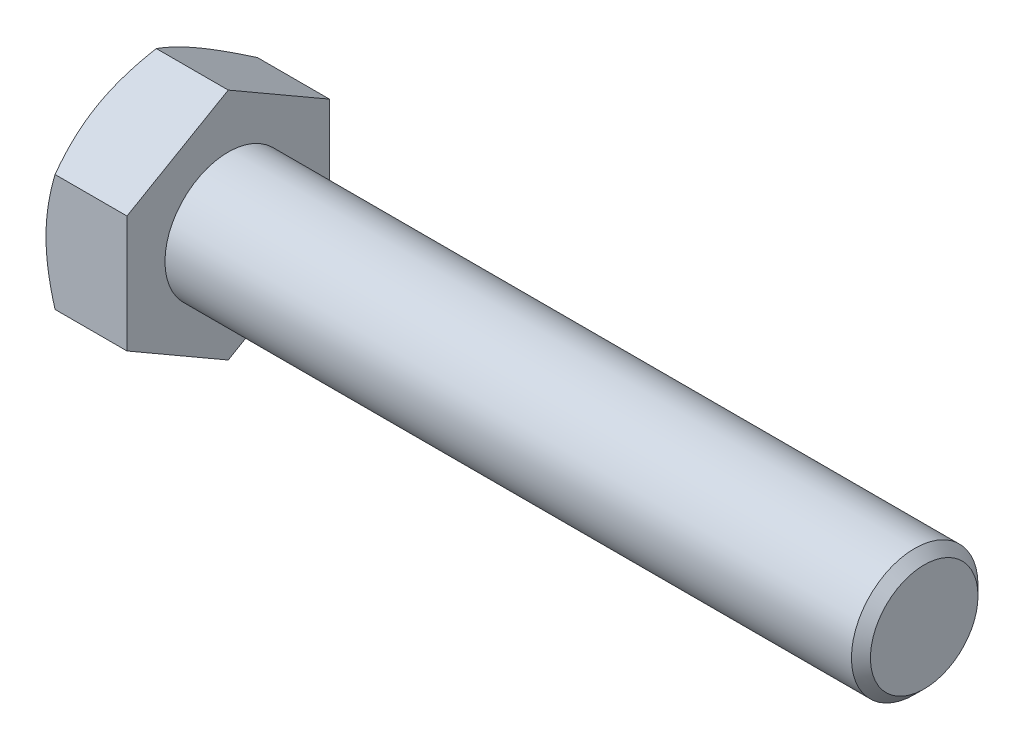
ISO-10303-21;
HEADER;
FILE_DESCRIPTION(('STEP AP214'),'2;1');
FILE_NAME('part.step','',(''),(''),'','','');
FILE_SCHEMA(('AUTOMOTIVE_DESIGN { 1 0 10303 214 1 1 1 1 }'));
ENDSEC;
DATA;
#1=APPLICATION_CONTEXT('core data for automotive mechanical design processes');
#2=APPLICATION_PROTOCOL_DEFINITION('international standard','automotive_design',2000,#1);
#3=PRODUCT_CONTEXT('',#1,'mechanical');
#4=PRODUCT('Part','Part','',(#3));
#5=PRODUCT_RELATED_PRODUCT_CATEGORY('part','',(#4));
#6=PRODUCT_DEFINITION_FORMATION('','',#4);
#7=PRODUCT_DEFINITION_CONTEXT('part definition',#1,'design');
#8=PRODUCT_DEFINITION('design','',#6,#7);
#9=PRODUCT_DEFINITION_SHAPE('','',#8);
#10=(LENGTH_UNIT() NAMED_UNIT(*) SI_UNIT(.MILLI.,.METRE.));
#11=(NAMED_UNIT(*) PLANE_ANGLE_UNIT() SI_UNIT($,.RADIAN.));
#12=(NAMED_UNIT(*) SI_UNIT($,.STERADIAN.) SOLID_ANGLE_UNIT());
#13=UNCERTAINTY_MEASURE_WITH_UNIT(LENGTH_MEASURE(1.E-05),#10,'distance_accuracy_value','');
#14=(GEOMETRIC_REPRESENTATION_CONTEXT(3) GLOBAL_UNCERTAINTY_ASSIGNED_CONTEXT((#13)) GLOBAL_UNIT_ASSIGNED_CONTEXT((#10,
#11,#12)) REPRESENTATION_CONTEXT('',''));
#15=CARTESIAN_POINT('',(0.,0.,0.));
#16=DIRECTION('',(0.,0.,1.));
#17=DIRECTION('',(1.,0.,0.));
#18=AXIS2_PLACEMENT_3D('',#15,#16,#17);
#19=CARTESIAN_POINT('',(55.,0.,0.));
#20=DIRECTION('',(-1.,0.,0.));
#21=DIRECTION('',(0.,0.,1.));
#22=AXIS2_PLACEMENT_3D('',#19,#20,#21);
#23=CYLINDRICAL_SURFACE('',#22,5.);
#24=CARTESIAN_POINT('',(54.25,0.,0.));
#25=DIRECTION('',(1.,0.,0.));
#26=DIRECTION('',(0.,0.,-1.));
#27=AXIS2_PLACEMENT_3D('',#24,#25,#26);
#28=CIRCLE('',#27,5.);
#29=CARTESIAN_POINT('',(54.25,0.,-5.));
#30=VERTEX_POINT('',#29);
#31=EDGE_CURVE('E11',#30,#30,#28,.F.);
#32=ORIENTED_EDGE('',*,*,#31,.T.);
#33=EDGE_LOOP('',(#32));
#34=FACE_BOUND('',#33,.T.);
#35=CARTESIAN_POINT('',(0.,0.,0.));
#36=DIRECTION('',(-1.,0.,0.));
#37=DIRECTION('',(0.,0.,1.));
#38=AXIS2_PLACEMENT_3D('',#35,#36,#37);
#39=CIRCLE('',#38,5.);
#40=CARTESIAN_POINT('',(0.,0.,5.));
#41=VERTEX_POINT('',#40);
#42=EDGE_CURVE('E202',#41,#41,#39,.T.);
#43=ORIENTED_EDGE('',*,*,#42,.F.);
#44=EDGE_LOOP('',(#43));
#45=FACE_BOUND('',#44,.T.);
#46=ADVANCED_FACE('F28',(#34,#45),#23,.T.);
#47=CARTESIAN_POINT('',(55.,0.,0.));
#48=DIRECTION('',(1.,0.,0.));
#49=DIRECTION('',(0.,0.,-1.));
#50=AXIS2_PLACEMENT_3D('',#47,#48,#49);
#51=PLANE('',#50);
#52=CARTESIAN_POINT('',(55.,0.,0.));
#53=DIRECTION('',(1.,0.,0.));
#54=DIRECTION('',(0.,0.,-1.));
#55=AXIS2_PLACEMENT_3D('',#52,#53,#54);
#56=CIRCLE('',#55,4.24999999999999);
#57=CARTESIAN_POINT('',(55.,0.,-4.24999999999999));
#58=VERTEX_POINT('',#57);
#59=EDGE_CURVE('E35',#58,#58,#56,.T.);
#60=ORIENTED_EDGE('',*,*,#59,.T.);
#61=EDGE_LOOP('',(#60));
#62=FACE_BOUND('',#61,.T.);
#63=ADVANCED_FACE('F188',(#62),#51,.T.);
#64=CARTESIAN_POINT('',(0.,-9.23760430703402,0.));
#65=DIRECTION('',(-1.,0.,0.));
#66=DIRECTION('',(0.,0.,1.));
#67=AXIS2_PLACEMENT_3D('',#64,#65,#66);
#68=PLANE('',#67);
#69=DIRECTION('',(0.,0.5,0.866025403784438));
#70=VECTOR('',#69,1.);
#71=CARTESIAN_POINT('',(0.,-9.23760430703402,0.));
#72=LINE('',#71,#70);
#73=CARTESIAN_POINT('',(0.,-9.23760430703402,0.));
#74=VERTEX_POINT('',#73);
#75=CARTESIAN_POINT('',(0.,-4.618802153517,8.));
#76=VERTEX_POINT('',#75);
#77=EDGE_CURVE('E229',#74,#76,#72,.T.);
#78=ORIENTED_EDGE('',*,*,#77,.F.);
#79=DIRECTION('',(0.,0.5,-0.866025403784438));
#80=VECTOR('',#79,1.);
#81=CARTESIAN_POINT('',(0.,-9.23760430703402,0.));
#82=LINE('',#81,#80);
#83=CARTESIAN_POINT('',(0.,-4.618802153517,-8.));
#84=VERTEX_POINT('',#83);
#85=EDGE_CURVE('E216',#74,#84,#82,.T.);
#86=ORIENTED_EDGE('',*,*,#85,.T.);
#87=DIRECTION('',(0.,1.,0.));
#88=VECTOR('',#87,1.);
#89=CARTESIAN_POINT('',(0.,-4.618802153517,-8.));
#90=LINE('',#89,#88);
#91=CARTESIAN_POINT('',(0.,4.61880215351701,-8.));
#92=VERTEX_POINT('',#91);
#93=EDGE_CURVE('E219',#84,#92,#90,.T.);
#94=ORIENTED_EDGE('',*,*,#93,.T.);
#95=DIRECTION('',(0.,0.5,0.866025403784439));
#96=VECTOR('',#95,1.);
#97=CARTESIAN_POINT('',(0.,4.61880215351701,-8.));
#98=LINE('',#97,#96);
#99=CARTESIAN_POINT('',(0.,9.23760430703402,0.));
#100=VERTEX_POINT('',#99);
#101=EDGE_CURVE('E222',#92,#100,#98,.T.);
#102=ORIENTED_EDGE('',*,*,#101,.T.);
#103=DIRECTION('',(0.,0.5,-0.866025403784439));
#104=VECTOR('',#103,1.);
#105=CARTESIAN_POINT('',(0.,4.61880215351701,8.));
#106=LINE('',#105,#104);
#107=CARTESIAN_POINT('',(0.,4.61880215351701,8.));
#108=VERTEX_POINT('',#107);
#109=EDGE_CURVE('E225',#108,#100,#106,.T.);
#110=ORIENTED_EDGE('',*,*,#109,.F.);
#111=DIRECTION('',(0.,1.,0.));
#112=VECTOR('',#111,1.);
#113=CARTESIAN_POINT('',(0.,-4.618802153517,8.));
#114=LINE('',#113,#112);
#115=EDGE_CURVE('E227',#76,#108,#114,.T.);
#116=ORIENTED_EDGE('',*,*,#115,.F.);
#117=EDGE_LOOP('',(#78,#86,#94,#102,#110,#116));
#118=FACE_BOUND('',#117,.T.);
#119=ORIENTED_EDGE('',*,*,#42,.T.);
#120=EDGE_LOOP('',(#119));
#121=FACE_BOUND('',#120,.T.);
#122=ADVANCED_FACE('F159',(#118,#121),#68,.F.);
#123=CARTESIAN_POINT('',(-6.4,-9.23760430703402,0.));
#124=DIRECTION('',(0.,0.866025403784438,-0.5));
#125=DIRECTION('',(0.,0.5,0.866025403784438));
#126=AXIS2_PLACEMENT_3D('',#123,#124,#125);
#127=PLANE('',#126);
#128=CARTESIAN_POINT('',(-5.68540215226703,-9.23771977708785,-0.000200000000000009));
#129=CARTESIAN_POINT('',(-5.7440092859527,-9.13619343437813,0.175648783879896));
#130=CARTESIAN_POINT('',(-5.79995659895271,-9.03428856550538,0.352153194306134));
#131=CARTESIAN_POINT('',(-5.90579899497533,-8.82965122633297,0.706595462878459));
#132=CARTESIAN_POINT('',(-5.95569146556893,-8.72691841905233,0.884533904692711));
#133=CARTESIAN_POINT('',(-6.09530720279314,-8.41707512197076,1.42119823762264));
#134=CARTESIAN_POINT('',(-6.17471882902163,-8.20874154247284,1.78204258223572));
#135=CARTESIAN_POINT('',(-6.26783835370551,-7.89697436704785,2.32203917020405));
#136=CARTESIAN_POINT('',(-6.29436541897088,-7.79447216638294,2.49957818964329));
#137=CARTESIAN_POINT('',(-6.33884682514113,-7.58900421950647,2.8554591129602));
#138=CARTESIAN_POINT('',(-6.35680192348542,-7.4860385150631,3.03380094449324));
#139=CARTESIAN_POINT('',(-6.38368435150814,-7.27992981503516,3.3907916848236));
#140=CARTESIAN_POINT('',(-6.39262192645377,-7.17678715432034,3.5694400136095));
#141=CARTESIAN_POINT('',(-6.40127769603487,-6.97040655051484,3.92690170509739));
#142=CARTESIAN_POINT('',(-6.40099617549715,-6.86716861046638,4.10571506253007));
#143=CARTESIAN_POINT('',(-6.39185497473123,-6.67416139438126,4.44001336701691));
#144=CARTESIAN_POINT('',(-6.38411039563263,-6.58437849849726,4.59552190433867));
#145=CARTESIAN_POINT('',(-6.36179886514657,-6.40502298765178,4.90617476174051));
#146=CARTESIAN_POINT('',(-6.34723145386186,-6.31545038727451,5.06131905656));
#147=CARTESIAN_POINT('',(-6.29363930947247,-6.04707935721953,5.52615131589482));
#148=CARTESIAN_POINT('',(-6.24473135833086,-5.86875596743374,5.83501648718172));
#149=CARTESIAN_POINT('',(-6.12246059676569,-5.51021755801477,6.4560232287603));
#150=CARTESIAN_POINT('',(-6.048579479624,-5.3300482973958,6.76808554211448));
#151=CARTESIAN_POINT('',(-5.88089985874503,-4.97239658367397,7.38755648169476));
#152=CARTESIAN_POINT('',(-5.78714073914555,-4.79490955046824,7.69497304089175));
#153=CARTESIAN_POINT('',(-5.68540215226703,-4.61868668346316,8.0002));
#154=B_SPLINE_CURVE_WITH_KNOTS('',3,(#128,#129,#130,#131,#132,#133,#134,#135,#136,#137,#138,
#139,#140,#141,#142,#143,#144,#145,#146,#147,#148,#149,#150,#151,#152,#153),.UNSPECIFIED.,.F.,
.F.,(4,2,2,2,2,2,2,2,2,2,2,2,4),(0.,0.633973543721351,1.26821965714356,2.53934712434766,
3.15934343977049,3.77928496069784,4.39852133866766,5.01773858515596,5.55680239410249,
6.09590254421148,7.17487077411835,8.27776850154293,9.37850115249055),.UNSPECIFIED.);
#155=CARTESIAN_POINT('',(-5.68546882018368,-9.23760430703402,0.));
#156=VERTEX_POINT('',#155);
#157=CARTESIAN_POINT('',(-6.4,-6.92820323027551,4.));
#158=VERTEX_POINT('',#157);
#159=EDGE_CURVE('E176',#156,#158,#154,.T.);
#160=ORIENTED_EDGE('',*,*,#159,.F.);
#161=DIRECTION('',(1.,0.,0.));
#162=VECTOR('',#161,1.);
#163=CARTESIAN_POINT('',(-6.4,-9.23760430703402,0.));
#164=LINE('',#163,#162);
#165=EDGE_CURVE('E214',#156,#74,#164,.T.);
#166=ORIENTED_EDGE('',*,*,#165,.T.);
#167=ORIENTED_EDGE('',*,*,#77,.T.);
#168=DIRECTION('',(1.,0.,0.));
#169=VECTOR('',#168,1.);
#170=CARTESIAN_POINT('',(-6.4,-4.618802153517,8.));
#171=LINE('',#170,#169);
#172=CARTESIAN_POINT('',(-5.68546882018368,-4.618802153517,8.));
#173=VERTEX_POINT('',#172);
#174=EDGE_CURVE('E205',#173,#76,#171,.T.);
#175=ORIENTED_EDGE('',*,*,#174,.F.);
#176=EDGE_CURVE('E130',#158,#173,#154,.T.);
#177=ORIENTED_EDGE('',*,*,#176,.F.);
#178=EDGE_LOOP('',(#160,#166,#167,#175,#177));
#179=FACE_BOUND('',#178,.T.);
#180=ADVANCED_FACE('F182',(#179),#127,.F.);
#181=CARTESIAN_POINT('',(-6.4,-4.618802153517,8.));
#182=DIRECTION('',(0.,0.,-1.));
#183=DIRECTION('',(-1.,0.,0.));
#184=AXIS2_PLACEMENT_3D('',#181,#182,#183);
#185=PLANE('',#184);
#186=CARTESIAN_POINT('',(-2.40281206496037,-12.5978512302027,8.));
#187=CARTESIAN_POINT('',(-2.57388946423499,-12.246746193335,8.));
#188=CARTESIAN_POINT('',(-2.74338074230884,-11.8948553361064,8.));
#189=CARTESIAN_POINT('',(-3.07830251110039,-11.1890846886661,8.));
#190=CARTESIAN_POINT('',(-3.24373239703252,-10.8352046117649,8.));
#191=CARTESIAN_POINT('',(-3.57043443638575,-10.1233054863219,8.));
#192=CARTESIAN_POINT('',(-3.73168065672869,-9.76527449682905,8.));
#193=CARTESIAN_POINT('',(-4.04782365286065,-9.0464305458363,8.));
#194=CARTESIAN_POINT('',(-4.20272071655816,-8.68561771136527,8.));
#195=CARTESIAN_POINT('',(-4.50960168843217,-7.94836823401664,8.));
#196=CARTESIAN_POINT('',(-4.66130959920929,-7.57181608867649,8.));
#197=CARTESIAN_POINT('',(-4.95369969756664,-6.81437869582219,8.));
#198=CARTESIAN_POINT('',(-5.09438067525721,-6.4334929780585,8.));
#199=CARTESIAN_POINT('',(-5.36116349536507,-5.66743059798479,8.));
#200=CARTESIAN_POINT('',(-5.48729325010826,-5.28226375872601,8.));
#201=CARTESIAN_POINT('',(-5.72105487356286,-4.50642197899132,8.));
#202=CARTESIAN_POINT('',(-5.82869236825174,-4.11574875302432,8.));
#203=CARTESIAN_POINT('',(-6.01985550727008,-3.3307685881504,8.));
#204=CARTESIAN_POINT('',(-6.10351603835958,-2.93649538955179,8.));
#205=CARTESIAN_POINT('',(-6.20749259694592,-2.34134760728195,8.));
#206=CARTESIAN_POINT('',(-6.23856705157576,-2.14232908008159,8.));
#207=CARTESIAN_POINT('',(-6.29294025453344,-1.74323916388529,8.));
#208=CARTESIAN_POINT('',(-6.31623975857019,-1.54316787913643,8.));
#209=CARTESIAN_POINT('',(-6.35429623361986,-1.14493807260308,8.));
#210=CARTESIAN_POINT('',(-6.36916434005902,-0.946790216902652,8.));
#211=CARTESIAN_POINT('',(-6.39050002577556,-0.550042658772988,8.));
#212=CARTESIAN_POINT('',(-6.39696775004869,-0.351442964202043,8.));
#213=CARTESIAN_POINT('',(-6.40134753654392,0.0458536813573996,8.));
#214=CARTESIAN_POINT('',(-6.39925955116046,0.244550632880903,8.));
#215=CARTESIAN_POINT('',(-6.38658102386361,0.641675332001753,8.));
#216=CARTESIAN_POINT('',(-6.37599009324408,0.840103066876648,8.));
#217=CARTESIAN_POINT('',(-6.34097810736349,1.31123186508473,8.));
#218=CARTESIAN_POINT('',(-6.31284309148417,1.58366327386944,8.));
#219=CARTESIAN_POINT('',(-6.24203710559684,2.12661564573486,8.));
#220=CARTESIAN_POINT('',(-6.19936432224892,2.39713636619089,8.));
#221=CARTESIAN_POINT('',(-6.05179305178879,3.20545284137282,8.));
#222=CARTESIAN_POINT('',(-5.92736416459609,3.73973646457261,8.));
#223=CARTESIAN_POINT('',(-5.71012995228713,4.53906436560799,8.));
#224=CARTESIAN_POINT('',(-5.63154182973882,4.80821183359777,8.));
#225=CARTESIAN_POINT('',(-5.46584170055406,5.34389592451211,8.));
#226=CARTESIAN_POINT('',(-5.37872962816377,5.61043252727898,8.));
#227=CARTESIAN_POINT('',(-5.19740915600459,6.14097486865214,8.));
#228=CARTESIAN_POINT('',(-5.10320275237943,6.40498129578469,8.));
#229=CARTESIAN_POINT('',(-4.90883812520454,6.93077992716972,8.));
#230=CARTESIAN_POINT('',(-4.80868003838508,7.19257218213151,8.));
#231=CARTESIAN_POINT('',(-4.53123135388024,7.89757234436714,8.));
#232=CARTESIAN_POINT('',(-4.34922056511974,8.33892089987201,8.));
#233=CARTESIAN_POINT('',(-3.97449001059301,9.21706508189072,8.));
#234=CARTESIAN_POINT('',(-3.78176905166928,9.65386019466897,8.));
#235=CARTESIAN_POINT('',(-3.38815487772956,10.5239434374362,8.));
#236=CARTESIAN_POINT('',(-3.18725853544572,10.9572301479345,8.));
#237=CARTESIAN_POINT('',(-2.77925077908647,11.8208356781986,8.));
#238=CARTESIAN_POINT('',(-2.57213961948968,12.2511546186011,8.));
#239=CARTESIAN_POINT('',(-2.15271844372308,13.1101061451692,8.));
#240=CARTESIAN_POINT('',(-1.94040058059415,13.5387348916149,8.));
#241=CARTESIAN_POINT('',(-1.51189757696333,14.3940561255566,8.));
#242=CARTESIAN_POINT('',(-1.29571240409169,14.8207485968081,8.));
#243=CARTESIAN_POINT('',(-0.860283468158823,15.6724483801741,8.));
#244=CARTESIAN_POINT('',(-0.641040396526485,16.0974560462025,8.));
#245=CARTESIAN_POINT('',(-0.200021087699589,16.9461557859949,8.));
#246=CARTESIAN_POINT('',(0.0217551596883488,17.3698478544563,8.));
#247=CARTESIAN_POINT('',(0.642968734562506,18.5495919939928,8.));
#248=CARTESIAN_POINT('',(1.04468640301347,19.3044430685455,8.));
#249=CARTESIAN_POINT('',(1.8529450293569,20.8116128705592,8.));
#250=CARTESIAN_POINT('',(2.25948628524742,21.5639314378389,8.));
#251=CARTESIAN_POINT('',(3.07479055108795,23.064082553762,8.));
#252=CARTESIAN_POINT('',(3.48354147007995,23.8119216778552,8.));
#253=CARTESIAN_POINT('',(4.09870759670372,24.9325210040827,8.));
#254=CARTESIAN_POINT('',(4.30409483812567,25.3058462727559,8.));
#255=CARTESIAN_POINT('',(4.71547851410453,26.0521604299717,8.));
#256=CARTESIAN_POINT('',(4.92147494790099,26.4251493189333,8.));
#257=CARTESIAN_POINT('',(5.12773824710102,26.7979906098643,8.));
#258=B_SPLINE_CURVE_WITH_KNOTS('',3,(#186,#187,#188,#189,#190,#191,#192,#193,#194,#195,#196,
#197,#198,#199,#200,#201,#202,#203,#204,#205,#206,#207,#208,#209,#210,#211,#212,#213,#214,#215,
#216,#217,#218,#219,#220,#221,#222,#223,#224,#225,#226,#227,#228,#229,#230,#231,#232,#233,#234,
#235,#236,#237,#238,#239,#240,#241,#242,#243,#244,#245,#246,#247,#248,#249,#250,#251,#252,#253,
#254,#255,#256,#257),.UNSPECIFIED.,.F.,.F.,(4,2,2,2,2,2,2,2,2,2,2,2,2,2,2,2,2,2,2,2,2,2,2,2,2,2,
2,2,2,2,2,2,2,2,2,4),(0.,1.17171303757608,2.34359951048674,3.52154779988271,4.69944261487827,
5.9172006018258,7.13509201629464,8.35060698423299,9.56575149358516,10.7739194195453,
11.3780811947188,11.982184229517,12.5781274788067,13.174060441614,13.7699967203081,
14.3659602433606,15.1871414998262,16.0084252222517,17.651791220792,18.4928743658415,
19.3339639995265,20.1748178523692,21.0156523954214,22.4476587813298,23.87982501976,
25.312544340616,26.7452050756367,28.1801767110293,29.6151603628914,31.0498246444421,
32.48449470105,35.0497345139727,37.6151336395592,40.1718943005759,41.4501744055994,
42.7284529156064),.UNSPECIFIED.);
#259=CARTESIAN_POINT('',(-6.4,0.,8.));
#260=VERTEX_POINT('',#259);
#261=EDGE_CURVE('E231',#173,#260,#258,.T.);
#262=ORIENTED_EDGE('',*,*,#261,.F.);
#263=ORIENTED_EDGE('',*,*,#174,.T.);
#264=ORIENTED_EDGE('',*,*,#115,.T.);
#265=DIRECTION('',(1.,0.,0.));
#266=VECTOR('',#265,1.);
#267=CARTESIAN_POINT('',(-6.4,4.61880215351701,8.));
#268=LINE('',#267,#266);
#269=CARTESIAN_POINT('',(-5.68546882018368,4.61880215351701,8.));
#270=VERTEX_POINT('',#269);
#271=EDGE_CURVE('E207',#270,#108,#268,.T.);
#272=ORIENTED_EDGE('',*,*,#271,.F.);
#273=EDGE_CURVE('E101',#260,#270,#258,.T.);
#274=ORIENTED_EDGE('',*,*,#273,.F.);
#275=EDGE_LOOP('',(#262,#263,#264,#272,#274));
#276=FACE_BOUND('',#275,.T.);
#277=ADVANCED_FACE('F185',(#276),#185,.F.);
#278=CARTESIAN_POINT('',(-6.4,4.61880215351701,8.));
#279=DIRECTION('',(0.,-0.866025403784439,-0.5));
#280=DIRECTION('',(0.,0.5,-0.866025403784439));
#281=AXIS2_PLACEMENT_3D('',#278,#279,#280);
#282=PLANE('',#281);
#283=CARTESIAN_POINT('',(-5.68540215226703,4.61868668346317,8.0002));
#284=CARTESIAN_POINT('',(-5.7440092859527,4.7202130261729,7.8243512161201));
#285=CARTESIAN_POINT('',(-5.79995659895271,4.82211789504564,7.64784680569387));
#286=CARTESIAN_POINT('',(-5.90579899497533,5.02675523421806,7.29340453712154));
#287=CARTESIAN_POINT('',(-5.95569146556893,5.1294880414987,7.11546609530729));
#288=CARTESIAN_POINT('',(-6.09530720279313,5.43933133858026,6.57880176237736));
#289=CARTESIAN_POINT('',(-6.17471882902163,5.64766491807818,6.21795741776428));
#290=CARTESIAN_POINT('',(-6.26783835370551,5.95943209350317,5.67796082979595));
#291=CARTESIAN_POINT('',(-6.29436541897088,6.06193429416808,5.50042181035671));
#292=CARTESIAN_POINT('',(-6.33884682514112,6.26740224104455,5.1445408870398));
#293=CARTESIAN_POINT('',(-6.35680192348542,6.37036794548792,4.96619905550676));
#294=CARTESIAN_POINT('',(-6.38368435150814,6.57647664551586,4.6092083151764));
#295=CARTESIAN_POINT('',(-6.39262192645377,6.67961930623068,4.4305599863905));
#296=CARTESIAN_POINT('',(-6.40127769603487,6.88599991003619,4.07309829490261));
#297=CARTESIAN_POINT('',(-6.40099617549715,6.98923785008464,3.89428493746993));
#298=CARTESIAN_POINT('',(-6.39185497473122,7.18224506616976,3.55998663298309));
#299=CARTESIAN_POINT('',(-6.38411039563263,7.27202796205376,3.40447809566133));
#300=CARTESIAN_POINT('',(-6.36179886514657,7.45138347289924,3.09382523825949));
#301=CARTESIAN_POINT('',(-6.34723145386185,7.54095607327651,2.93868094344));
#302=CARTESIAN_POINT('',(-6.29363930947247,7.80932710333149,2.47384868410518));
#303=CARTESIAN_POINT('',(-6.24473135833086,7.98765049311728,2.16498351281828));
#304=CARTESIAN_POINT('',(-6.12246059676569,8.34618890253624,1.5439767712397));
#305=CARTESIAN_POINT('',(-6.048579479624,8.52635816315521,1.23191445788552));
#306=CARTESIAN_POINT('',(-5.88089985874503,8.88400987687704,0.612443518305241));
#307=CARTESIAN_POINT('',(-5.78714073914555,9.06149691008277,0.305026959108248));
#308=CARTESIAN_POINT('',(-5.68540215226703,9.23771977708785,-0.000200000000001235));
#309=B_SPLINE_CURVE_WITH_KNOTS('',3,(#283,#284,#285,#286,#287,#288,#289,#290,#291,#292,#293,
#294,#295,#296,#297,#298,#299,#300,#301,#302,#303,#304,#305,#306,#307,#308),.UNSPECIFIED.,.F.,
.F.,(4,2,2,2,2,2,2,2,2,2,2,2,4),(0.,0.633973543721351,1.26821965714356,2.53934712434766,
3.15934343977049,3.77928496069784,4.39852133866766,5.01773858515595,5.55680239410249,
6.09590254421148,7.17487077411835,8.27776850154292,9.37850115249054),.UNSPECIFIED.);
#310=CARTESIAN_POINT('',(-6.4,6.92820323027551,4.));
#311=VERTEX_POINT('',#310);
#312=EDGE_CURVE('E97',#270,#311,#309,.T.);
#313=ORIENTED_EDGE('',*,*,#312,.F.);
#314=ORIENTED_EDGE('',*,*,#271,.T.);
#315=ORIENTED_EDGE('',*,*,#109,.T.);
#316=DIRECTION('',(1.,0.,0.));
#317=VECTOR('',#316,1.);
#318=CARTESIAN_POINT('',(-6.4,9.23760430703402,0.));
#319=LINE('',#318,#317);
#320=CARTESIAN_POINT('',(-5.68546882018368,9.23760430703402,0.));
#321=VERTEX_POINT('',#320);
#322=EDGE_CURVE('E129',#321,#100,#319,.T.);
#323=ORIENTED_EDGE('',*,*,#322,.F.);
#324=EDGE_CURVE('E105',#311,#321,#309,.T.);
#325=ORIENTED_EDGE('',*,*,#324,.F.);
#326=EDGE_LOOP('',(#313,#314,#315,#323,#325));
#327=FACE_BOUND('',#326,.T.);
#328=ADVANCED_FACE('F127',(#327),#282,.F.);
#329=CARTESIAN_POINT('',(-6.4,4.61880215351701,-8.));
#330=DIRECTION('',(0.,0.866025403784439,-0.5));
#331=DIRECTION('',(0.,0.5,0.866025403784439));
#332=AXIS2_PLACEMENT_3D('',#329,#330,#331);
#333=PLANE('',#332);
#334=DIRECTION('',(1.,0.,0.));
#335=VECTOR('',#334,1.);
#336=CARTESIAN_POINT('',(-6.4,4.61880215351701,-8.));
#337=LINE('',#336,#335);
#338=CARTESIAN_POINT('',(-5.68546882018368,4.61880215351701,-8.));
#339=VERTEX_POINT('',#338);
#340=EDGE_CURVE('E210',#339,#92,#337,.T.);
#341=ORIENTED_EDGE('',*,*,#340,.F.);
#342=CARTESIAN_POINT('',(-5.68540215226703,4.61868668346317,-8.0002));
#343=CARTESIAN_POINT('',(-5.7440092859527,4.7202130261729,-7.8243512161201));
#344=CARTESIAN_POINT('',(-5.79995659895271,4.82211789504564,-7.64784680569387));
#345=CARTESIAN_POINT('',(-5.90579899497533,5.02675523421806,-7.29340453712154));
#346=CARTESIAN_POINT('',(-5.95569146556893,5.1294880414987,-7.11546609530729));
#347=CARTESIAN_POINT('',(-6.09530720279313,5.43933133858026,-6.57880176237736));
#348=CARTESIAN_POINT('',(-6.17471882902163,5.64766491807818,-6.21795741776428));
#349=CARTESIAN_POINT('',(-6.26783835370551,5.95943209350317,-5.67796082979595));
#350=CARTESIAN_POINT('',(-6.29436541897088,6.06193429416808,-5.50042181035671));
#351=CARTESIAN_POINT('',(-6.33884682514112,6.26740224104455,-5.1445408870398));
#352=CARTESIAN_POINT('',(-6.35680192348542,6.37036794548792,-4.96619905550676));
#353=CARTESIAN_POINT('',(-6.38368435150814,6.57647664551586,-4.6092083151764));
#354=CARTESIAN_POINT('',(-6.39262192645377,6.67961930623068,-4.4305599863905));
#355=CARTESIAN_POINT('',(-6.40127769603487,6.88599991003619,-4.07309829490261));
#356=CARTESIAN_POINT('',(-6.40099617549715,6.98923785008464,-3.89428493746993));
#357=CARTESIAN_POINT('',(-6.39185497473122,7.18224506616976,-3.55998663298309));
#358=CARTESIAN_POINT('',(-6.38411039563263,7.27202796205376,-3.40447809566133));
#359=CARTESIAN_POINT('',(-6.36179886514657,7.45138347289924,-3.09382523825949));
#360=CARTESIAN_POINT('',(-6.34723145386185,7.54095607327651,-2.93868094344));
#361=CARTESIAN_POINT('',(-6.29363930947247,7.80932710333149,-2.47384868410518));
#362=CARTESIAN_POINT('',(-6.24473135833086,7.98765049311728,-2.16498351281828));
#363=CARTESIAN_POINT('',(-6.12246059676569,8.34618890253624,-1.5439767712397));
#364=CARTESIAN_POINT('',(-6.048579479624,8.52635816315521,-1.23191445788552));
#365=CARTESIAN_POINT('',(-5.88089985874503,8.88400987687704,-0.612443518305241));
#366=CARTESIAN_POINT('',(-5.78714073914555,9.06149691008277,-0.305026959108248));
#367=CARTESIAN_POINT('',(-5.68540215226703,9.23771977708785,0.000200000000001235));
#368=B_SPLINE_CURVE_WITH_KNOTS('',3,(#342,#343,#344,#345,#346,#347,#348,#349,#350,#351,#352,
#353,#354,#355,#356,#357,#358,#359,#360,#361,#362,#363,#364,#365,#366,#367),.UNSPECIFIED.,.F.,
.F.,(4,2,2,2,2,2,2,2,2,2,2,2,4),(0.,0.633973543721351,1.26821965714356,2.53934712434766,
3.15934343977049,3.77928496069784,4.39852133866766,5.01773858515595,5.55680239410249,
6.09590254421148,7.17487077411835,8.27776850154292,9.37850115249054),.UNSPECIFIED.);
#369=CARTESIAN_POINT('',(-6.4,6.92820323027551,-4.));
#370=VERTEX_POINT('',#369);
#371=EDGE_CURVE('E132',#339,#370,#368,.T.);
#372=ORIENTED_EDGE('',*,*,#371,.T.);
#373=EDGE_CURVE('E112',#370,#321,#368,.T.);
#374=ORIENTED_EDGE('',*,*,#373,.T.);
#375=ORIENTED_EDGE('',*,*,#322,.T.);
#376=ORIENTED_EDGE('',*,*,#101,.F.);
#377=EDGE_LOOP('',(#341,#372,#374,#375,#376));
#378=FACE_BOUND('',#377,.T.);
#379=ADVANCED_FACE('F257',(#378),#333,.T.);
#380=CARTESIAN_POINT('',(-6.4,-4.618802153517,-8.));
#381=DIRECTION('',(0.,0.,-1.));
#382=DIRECTION('',(-1.,0.,0.));
#383=AXIS2_PLACEMENT_3D('',#380,#381,#382);
#384=PLANE('',#383);
#385=DIRECTION('',(1.,0.,0.));
#386=VECTOR('',#385,1.);
#387=CARTESIAN_POINT('',(-6.4,-4.618802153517,-8.));
#388=LINE('',#387,#386);
#389=CARTESIAN_POINT('',(-5.68546882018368,-4.618802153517,-8.));
#390=VERTEX_POINT('',#389);
#391=EDGE_CURVE('E212',#390,#84,#388,.T.);
#392=ORIENTED_EDGE('',*,*,#391,.F.);
#393=CARTESIAN_POINT('',(-2.40281206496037,-12.5978512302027,-8.));
#394=CARTESIAN_POINT('',(-2.57388946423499,-12.246746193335,-8.));
#395=CARTESIAN_POINT('',(-2.74338074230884,-11.8948553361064,-8.));
#396=CARTESIAN_POINT('',(-3.07830251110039,-11.1890846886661,-8.));
#397=CARTESIAN_POINT('',(-3.24373239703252,-10.8352046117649,-8.));
#398=CARTESIAN_POINT('',(-3.57043443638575,-10.1233054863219,-8.));
#399=CARTESIAN_POINT('',(-3.73168065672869,-9.76527449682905,-8.));
#400=CARTESIAN_POINT('',(-4.04782365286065,-9.0464305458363,-8.));
#401=CARTESIAN_POINT('',(-4.20272071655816,-8.68561771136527,-8.));
#402=CARTESIAN_POINT('',(-4.50960168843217,-7.94836823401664,-8.));
#403=CARTESIAN_POINT('',(-4.66130959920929,-7.57181608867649,-8.));
#404=CARTESIAN_POINT('',(-4.95369969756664,-6.81437869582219,-8.));
#405=CARTESIAN_POINT('',(-5.09438067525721,-6.4334929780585,-8.));
#406=CARTESIAN_POINT('',(-5.36116349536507,-5.66743059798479,-8.));
#407=CARTESIAN_POINT('',(-5.48729325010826,-5.28226375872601,-8.));
#408=CARTESIAN_POINT('',(-5.72105487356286,-4.50642197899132,-8.));
#409=CARTESIAN_POINT('',(-5.82869236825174,-4.11574875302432,-8.));
#410=CARTESIAN_POINT('',(-6.01985550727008,-3.3307685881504,-8.));
#411=CARTESIAN_POINT('',(-6.10351603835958,-2.93649538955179,-8.));
#412=CARTESIAN_POINT('',(-6.20749259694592,-2.34134760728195,-8.));
#413=CARTESIAN_POINT('',(-6.23856705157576,-2.14232908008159,-8.));
#414=CARTESIAN_POINT('',(-6.29294025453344,-1.74323916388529,-8.));
#415=CARTESIAN_POINT('',(-6.31623975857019,-1.54316787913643,-8.));
#416=CARTESIAN_POINT('',(-6.35429623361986,-1.14493807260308,-8.));
#417=CARTESIAN_POINT('',(-6.36916434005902,-0.946790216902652,-8.));
#418=CARTESIAN_POINT('',(-6.39050002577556,-0.550042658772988,-8.));
#419=CARTESIAN_POINT('',(-6.39696775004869,-0.351442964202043,-8.));
#420=CARTESIAN_POINT('',(-6.40134753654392,0.0458536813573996,-8.));
#421=CARTESIAN_POINT('',(-6.39925955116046,0.244550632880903,-8.));
#422=CARTESIAN_POINT('',(-6.38658102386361,0.641675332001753,-8.));
#423=CARTESIAN_POINT('',(-6.37599009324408,0.840103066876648,-8.));
#424=CARTESIAN_POINT('',(-6.34097810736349,1.31123186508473,-8.));
#425=CARTESIAN_POINT('',(-6.31284309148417,1.58366327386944,-8.));
#426=CARTESIAN_POINT('',(-6.24203710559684,2.12661564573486,-8.));
#427=CARTESIAN_POINT('',(-6.19936432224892,2.39713636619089,-8.));
#428=CARTESIAN_POINT('',(-6.05179305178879,3.20545284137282,-8.));
#429=CARTESIAN_POINT('',(-5.92736416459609,3.73973646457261,-8.));
#430=CARTESIAN_POINT('',(-5.71012995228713,4.53906436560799,-8.));
#431=CARTESIAN_POINT('',(-5.63154182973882,4.80821183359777,-8.));
#432=CARTESIAN_POINT('',(-5.46584170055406,5.34389592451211,-8.));
#433=CARTESIAN_POINT('',(-5.37872962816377,5.61043252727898,-8.));
#434=CARTESIAN_POINT('',(-5.19740915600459,6.14097486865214,-8.));
#435=CARTESIAN_POINT('',(-5.10320275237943,6.40498129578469,-8.));
#436=CARTESIAN_POINT('',(-4.90883812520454,6.93077992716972,-8.));
#437=CARTESIAN_POINT('',(-4.80868003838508,7.19257218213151,-8.));
#438=CARTESIAN_POINT('',(-4.53123135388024,7.89757234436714,-8.));
#439=CARTESIAN_POINT('',(-4.34922056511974,8.33892089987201,-8.));
#440=CARTESIAN_POINT('',(-3.97449001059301,9.21706508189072,-8.));
#441=CARTESIAN_POINT('',(-3.78176905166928,9.65386019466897,-8.));
#442=CARTESIAN_POINT('',(-3.38815487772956,10.5239434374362,-8.));
#443=CARTESIAN_POINT('',(-3.18725853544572,10.9572301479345,-8.));
#444=CARTESIAN_POINT('',(-2.77925077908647,11.8208356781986,-8.));
#445=CARTESIAN_POINT('',(-2.57213961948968,12.2511546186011,-8.));
#446=CARTESIAN_POINT('',(-2.15271844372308,13.1101061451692,-8.));
#447=CARTESIAN_POINT('',(-1.94040058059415,13.5387348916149,-8.));
#448=CARTESIAN_POINT('',(-1.51189757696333,14.3940561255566,-8.));
#449=CARTESIAN_POINT('',(-1.29571240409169,14.8207485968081,-8.));
#450=CARTESIAN_POINT('',(-0.860283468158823,15.6724483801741,-8.));
#451=CARTESIAN_POINT('',(-0.641040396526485,16.0974560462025,-8.));
#452=CARTESIAN_POINT('',(-0.200021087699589,16.9461557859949,-8.));
#453=CARTESIAN_POINT('',(0.0217551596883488,17.3698478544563,-8.));
#454=CARTESIAN_POINT('',(0.642968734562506,18.5495919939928,-8.));
#455=CARTESIAN_POINT('',(1.04468640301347,19.3044430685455,-8.));
#456=CARTESIAN_POINT('',(1.8529450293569,20.8116128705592,-8.));
#457=CARTESIAN_POINT('',(2.25948628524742,21.5639314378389,-8.));
#458=CARTESIAN_POINT('',(3.07479055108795,23.064082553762,-8.));
#459=CARTESIAN_POINT('',(3.48354147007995,23.8119216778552,-8.));
#460=CARTESIAN_POINT('',(4.09870759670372,24.9325210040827,-8.));
#461=CARTESIAN_POINT('',(4.30409483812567,25.3058462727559,-8.));
#462=CARTESIAN_POINT('',(4.71547851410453,26.0521604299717,-8.));
#463=CARTESIAN_POINT('',(4.92147494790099,26.4251493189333,-8.));
#464=CARTESIAN_POINT('',(5.12773824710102,26.7979906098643,-8.));
#465=B_SPLINE_CURVE_WITH_KNOTS('',3,(#393,#394,#395,#396,#397,#398,#399,#400,#401,#402,#403,
#404,#405,#406,#407,#408,#409,#410,#411,#412,#413,#414,#415,#416,#417,#418,#419,#420,#421,#422,
#423,#424,#425,#426,#427,#428,#429,#430,#431,#432,#433,#434,#435,#436,#437,#438,#439,#440,#441,
#442,#443,#444,#445,#446,#447,#448,#449,#450,#451,#452,#453,#454,#455,#456,#457,#458,#459,#460,
#461,#462,#463,#464),.UNSPECIFIED.,.F.,.F.,(4,2,2,2,2,2,2,2,2,2,2,2,2,2,2,2,2,2,2,2,2,2,2,2,2,2,
2,2,2,2,2,2,2,2,2,4),(0.,1.17171303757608,2.34359951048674,3.52154779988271,4.69944261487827,
5.9172006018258,7.13509201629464,8.35060698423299,9.56575149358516,10.7739194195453,
11.3780811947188,11.982184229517,12.5781274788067,13.174060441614,13.7699967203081,
14.3659602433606,15.1871414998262,16.0084252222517,17.651791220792,18.4928743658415,
19.3339639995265,20.1748178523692,21.0156523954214,22.4476587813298,23.87982501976,
25.312544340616,26.7452050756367,28.1801767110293,29.6151603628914,31.0498246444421,
32.48449470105,35.0497345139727,37.6151336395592,40.1718943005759,41.4501744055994,
42.7284529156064),.UNSPECIFIED.);
#466=CARTESIAN_POINT('',(-6.4,0.,-8.));
#467=VERTEX_POINT('',#466);
#468=EDGE_CURVE('E50',#390,#467,#465,.T.);
#469=ORIENTED_EDGE('',*,*,#468,.T.);
#470=EDGE_CURVE('E181',#467,#339,#465,.T.);
#471=ORIENTED_EDGE('',*,*,#470,.T.);
#472=ORIENTED_EDGE('',*,*,#340,.T.);
#473=ORIENTED_EDGE('',*,*,#93,.F.);
#474=EDGE_LOOP('',(#392,#469,#471,#472,#473));
#475=FACE_BOUND('',#474,.T.);
#476=ADVANCED_FACE('F253',(#475),#384,.T.);
#477=CARTESIAN_POINT('',(-6.4,-9.23760430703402,0.));
#478=DIRECTION('',(0.,-0.866025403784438,-0.5));
#479=DIRECTION('',(0.,0.5,-0.866025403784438));
#480=AXIS2_PLACEMENT_3D('',#477,#478,#479);
#481=PLANE('',#480);
#482=ORIENTED_EDGE('',*,*,#165,.F.);
#483=CARTESIAN_POINT('',(-5.68540215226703,-9.23771977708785,0.000200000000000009));
#484=CARTESIAN_POINT('',(-5.7440092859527,-9.13619343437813,-0.175648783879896));
#485=CARTESIAN_POINT('',(-5.79995659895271,-9.03428856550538,-0.352153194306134));
#486=CARTESIAN_POINT('',(-5.90579899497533,-8.82965122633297,-0.706595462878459));
#487=CARTESIAN_POINT('',(-5.95569146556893,-8.72691841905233,-0.884533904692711));
#488=CARTESIAN_POINT('',(-6.09530720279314,-8.41707512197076,-1.42119823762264));
#489=CARTESIAN_POINT('',(-6.17471882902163,-8.20874154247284,-1.78204258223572));
#490=CARTESIAN_POINT('',(-6.26783835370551,-7.89697436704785,-2.32203917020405));
#491=CARTESIAN_POINT('',(-6.29436541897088,-7.79447216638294,-2.49957818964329));
#492=CARTESIAN_POINT('',(-6.33884682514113,-7.58900421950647,-2.8554591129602));
#493=CARTESIAN_POINT('',(-6.35680192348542,-7.4860385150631,-3.03380094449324));
#494=CARTESIAN_POINT('',(-6.38368435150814,-7.27992981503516,-3.3907916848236));
#495=CARTESIAN_POINT('',(-6.39262192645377,-7.17678715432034,-3.5694400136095));
#496=CARTESIAN_POINT('',(-6.40127769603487,-6.97040655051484,-3.92690170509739));
#497=CARTESIAN_POINT('',(-6.40099617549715,-6.86716861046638,-4.10571506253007));
#498=CARTESIAN_POINT('',(-6.39185497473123,-6.67416139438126,-4.44001336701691));
#499=CARTESIAN_POINT('',(-6.38411039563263,-6.58437849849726,-4.59552190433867));
#500=CARTESIAN_POINT('',(-6.36179886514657,-6.40502298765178,-4.90617476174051));
#501=CARTESIAN_POINT('',(-6.34723145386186,-6.31545038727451,-5.06131905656));
#502=CARTESIAN_POINT('',(-6.29363930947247,-6.04707935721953,-5.52615131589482));
#503=CARTESIAN_POINT('',(-6.24473135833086,-5.86875596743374,-5.83501648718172));
#504=CARTESIAN_POINT('',(-6.12246059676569,-5.51021755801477,-6.4560232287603));
#505=CARTESIAN_POINT('',(-6.048579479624,-5.3300482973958,-6.76808554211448));
#506=CARTESIAN_POINT('',(-5.88089985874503,-4.97239658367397,-7.38755648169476));
#507=CARTESIAN_POINT('',(-5.78714073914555,-4.79490955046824,-7.69497304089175));
#508=CARTESIAN_POINT('',(-5.68540215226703,-4.61868668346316,-8.0002));
#509=B_SPLINE_CURVE_WITH_KNOTS('',3,(#483,#484,#485,#486,#487,#488,#489,#490,#491,#492,#493,
#494,#495,#496,#497,#498,#499,#500,#501,#502,#503,#504,#505,#506,#507,#508),.UNSPECIFIED.,.F.,
.F.,(4,2,2,2,2,2,2,2,2,2,2,2,4),(0.,0.633973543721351,1.26821965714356,2.53934712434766,
3.15934343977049,3.77928496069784,4.39852133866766,5.01773858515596,5.55680239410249,
6.09590254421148,7.17487077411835,8.27776850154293,9.37850115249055),.UNSPECIFIED.);
#510=CARTESIAN_POINT('',(-6.4,-6.92820323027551,-4.));
#511=VERTEX_POINT('',#510);
#512=EDGE_CURVE('E245',#156,#511,#509,.T.);
#513=ORIENTED_EDGE('',*,*,#512,.T.);
#514=EDGE_CURVE('E124',#511,#390,#509,.T.);
#515=ORIENTED_EDGE('',*,*,#514,.T.);
#516=ORIENTED_EDGE('',*,*,#391,.T.);
#517=ORIENTED_EDGE('',*,*,#85,.F.);
#518=EDGE_LOOP('',(#482,#513,#515,#516,#517));
#519=FACE_BOUND('',#518,.T.);
#520=ADVANCED_FACE('F249',(#519),#481,.T.);
#521=CARTESIAN_POINT('',(-6.4,0.,0.));
#522=DIRECTION('',(1.,0.,0.));
#523=DIRECTION('',(0.,0.,1.));
#524=AXIS2_PLACEMENT_3D('',#521,#522,#523);
#525=CONICAL_SURFACE('',#524,8.,1.0471975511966);
#526=ORIENTED_EDGE('',*,*,#176,.T.);
#527=ORIENTED_EDGE('',*,*,#261,.T.);
#528=CARTESIAN_POINT('',(-6.4,0.,0.));
#529=DIRECTION('',(-1.,0.,0.));
#530=DIRECTION('',(0.,0.,1.));
#531=AXIS2_PLACEMENT_3D('',#528,#529,#530);
#532=CIRCLE('',#531,8.);
#533=EDGE_CURVE('E119',#158,#260,#532,.T.);
#534=ORIENTED_EDGE('',*,*,#533,.F.);
#535=EDGE_LOOP('',(#526,#527,#534));
#536=FACE_BOUND('',#535,.T.);
#537=ADVANCED_FACE('F157',(#536),#525,.T.);
#538=ORIENTED_EDGE('',*,*,#512,.F.);
#539=ORIENTED_EDGE('',*,*,#159,.T.);
#540=EDGE_CURVE('E201',#511,#158,#532,.T.);
#541=ORIENTED_EDGE('',*,*,#540,.F.);
#542=EDGE_LOOP('',(#538,#539,#541));
#543=FACE_BOUND('',#542,.T.);
#544=ADVANCED_FACE('F156',(#543),#525,.T.);
#545=ORIENTED_EDGE('',*,*,#468,.F.);
#546=ORIENTED_EDGE('',*,*,#514,.F.);
#547=EDGE_CURVE('E288',#467,#511,#532,.T.);
#548=ORIENTED_EDGE('',*,*,#547,.F.);
#549=EDGE_LOOP('',(#545,#546,#548));
#550=FACE_BOUND('',#549,.T.);
#551=ADVANCED_FACE('F150',(#550),#525,.T.);
#552=ORIENTED_EDGE('',*,*,#371,.F.);
#553=ORIENTED_EDGE('',*,*,#470,.F.);
#554=EDGE_CURVE('E117',#370,#467,#532,.T.);
#555=ORIENTED_EDGE('',*,*,#554,.F.);
#556=EDGE_LOOP('',(#552,#553,#555));
#557=FACE_BOUND('',#556,.T.);
#558=ADVANCED_FACE('F155',(#557),#525,.T.);
#559=EDGE_CURVE('E109',#311,#370,#532,.T.);
#560=ORIENTED_EDGE('',*,*,#559,.F.);
#561=ORIENTED_EDGE('',*,*,#324,.T.);
#562=ORIENTED_EDGE('',*,*,#373,.F.);
#563=EDGE_LOOP('',(#560,#561,#562));
#564=FACE_BOUND('',#563,.T.);
#565=ADVANCED_FACE('F110',(#564),#525,.T.);
#566=CARTESIAN_POINT('',(-6.4,0.,0.));
#567=DIRECTION('',(-1.,0.,0.));
#568=DIRECTION('',(0.,0.,1.));
#569=AXIS2_PLACEMENT_3D('',#566,#567,#568);
#570=CIRCLE('',#569,8.);
#571=EDGE_CURVE('E42',#260,#311,#570,.T.);
#572=ORIENTED_EDGE('',*,*,#571,.F.);
#573=ORIENTED_EDGE('',*,*,#273,.T.);
#574=ORIENTED_EDGE('',*,*,#312,.T.);
#575=EDGE_LOOP('',(#572,#573,#574));
#576=FACE_BOUND('',#575,.T.);
#577=ADVANCED_FACE('F99',(#576),#525,.T.);
#578=CARTESIAN_POINT('',(-6.4,-9.23760430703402,0.));
#579=DIRECTION('',(-1.,0.,0.));
#580=DIRECTION('',(0.,0.,1.));
#581=AXIS2_PLACEMENT_3D('',#578,#579,#580);
#582=PLANE('',#581);
#583=ORIENTED_EDGE('',*,*,#533,.T.);
#584=ORIENTED_EDGE('',*,*,#571,.T.);
#585=ORIENTED_EDGE('',*,*,#559,.T.);
#586=ORIENTED_EDGE('',*,*,#554,.T.);
#587=ORIENTED_EDGE('',*,*,#547,.T.);
#588=ORIENTED_EDGE('',*,*,#540,.T.);
#589=EDGE_LOOP('',(#583,#584,#585,#586,#587,#588));
#590=FACE_BOUND('',#589,.T.);
#591=ADVANCED_FACE('F121',(#590),#582,.T.);
#592=CARTESIAN_POINT('',(55.,0.,0.));
#593=DIRECTION('',(-1.,0.,0.));
#594=DIRECTION('',(0.,0.,1.));
#595=AXIS2_PLACEMENT_3D('',#592,#593,#594);
#596=CONICAL_SURFACE('',#595,4.24999999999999,0.785398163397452);
#597=ORIENTED_EDGE('',*,*,#31,.F.);
#598=EDGE_LOOP('',(#597));
#599=FACE_BOUND('',#598,.T.);
#600=ORIENTED_EDGE('',*,*,#59,.F.);
#601=EDGE_LOOP('',(#600));
#602=FACE_BOUND('',#601,.T.);
#603=ADVANCED_FACE('F158',(#599,#602),#596,.T.);
#604=CLOSED_SHELL('',(#46,#63,#122,#180,#277,#328,#379,#476,#520,#537,#544,#551,#558,#565,#577,
#591,#603));
#605=MANIFOLD_SOLID_BREP('B2',#604);
#606=ADVANCED_BREP_SHAPE_REPRESENTATION('',(#18,#605),#14);
#607=SHAPE_DEFINITION_REPRESENTATION(#9,#606);
ENDSEC;
END-ISO-10303-21;
